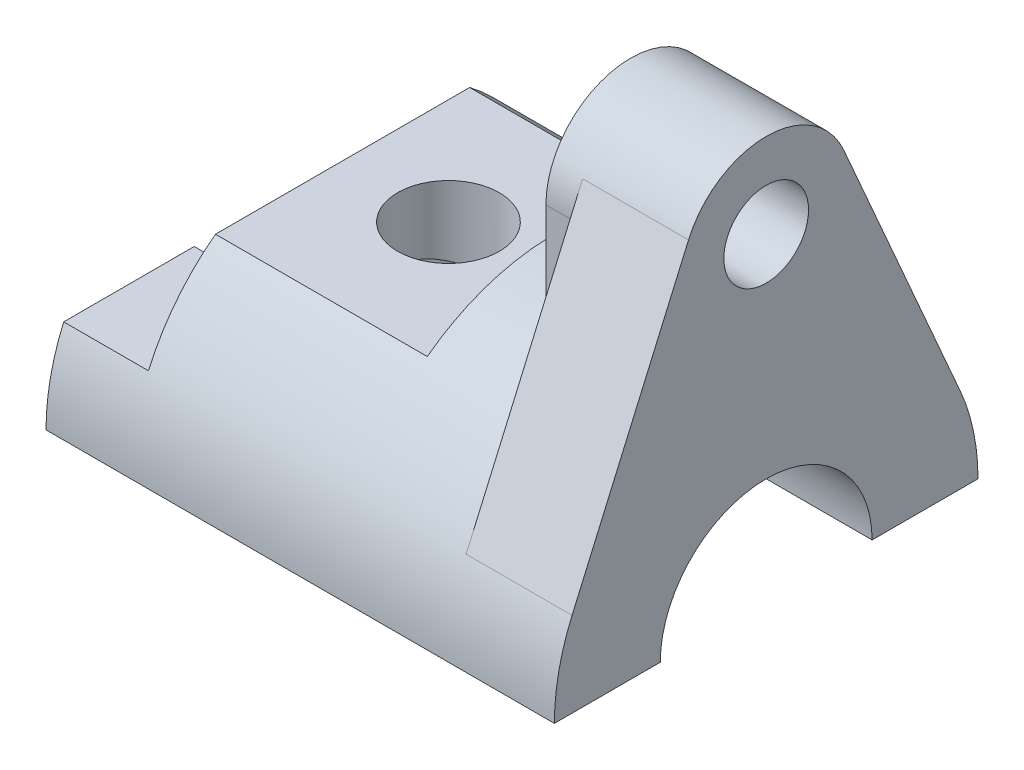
ISO-10303-21;
HEADER;
FILE_DESCRIPTION(('STEP AP214'),'2;1');
FILE_NAME('part.step','',(''),(''),'','','');
FILE_SCHEMA(('AUTOMOTIVE_DESIGN { 1 0 10303 214 1 1 1 1 }'));
ENDSEC;
DATA;
#1=APPLICATION_CONTEXT('core data for automotive mechanical design processes');
#2=APPLICATION_PROTOCOL_DEFINITION('international standard','automotive_design',2000,#1);
#3=PRODUCT_CONTEXT('',#1,'mechanical');
#4=PRODUCT('Part','Part','',(#3));
#5=PRODUCT_RELATED_PRODUCT_CATEGORY('part','',(#4));
#6=PRODUCT_DEFINITION_FORMATION('','',#4);
#7=PRODUCT_DEFINITION_CONTEXT('part definition',#1,'design');
#8=PRODUCT_DEFINITION('design','',#6,#7);
#9=PRODUCT_DEFINITION_SHAPE('','',#8);
#10=(LENGTH_UNIT() NAMED_UNIT(*) SI_UNIT(.MILLI.,.METRE.));
#11=(NAMED_UNIT(*) PLANE_ANGLE_UNIT() SI_UNIT($,.RADIAN.));
#12=(NAMED_UNIT(*) SI_UNIT($,.STERADIAN.) SOLID_ANGLE_UNIT());
#13=UNCERTAINTY_MEASURE_WITH_UNIT(LENGTH_MEASURE(1.E-05),#10,'distance_accuracy_value','');
#14=(GEOMETRIC_REPRESENTATION_CONTEXT(3) GLOBAL_UNCERTAINTY_ASSIGNED_CONTEXT((#13)) GLOBAL_UNIT_ASSIGNED_CONTEXT((#10,
#11,#12)) REPRESENTATION_CONTEXT('',''));
#15=CARTESIAN_POINT('',(0.,0.,0.));
#16=DIRECTION('',(0.,0.,1.));
#17=DIRECTION('',(1.,0.,0.));
#18=AXIS2_PLACEMENT_3D('',#15,#16,#17);
#19=CARTESIAN_POINT('',(-120.,0.,0.));
#20=DIRECTION('',(1.,0.,0.));
#21=DIRECTION('',(0.,0.,-1.));
#22=AXIS2_PLACEMENT_3D('',#19,#20,#21);
#23=PLANE('',#22);
#24=CARTESIAN_POINT('',(-120.,0.,0.));
#25=DIRECTION('',(1.,0.,0.));
#26=DIRECTION('',(0.,0.,-1.));
#27=AXIS2_PLACEMENT_3D('',#24,#25,#26);
#28=CIRCLE('',#27,50.);
#29=CARTESIAN_POINT('',(-120.,20.,45.8257569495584));
#30=VERTEX_POINT('',#29);
#31=CARTESIAN_POINT('',(-120.,0.,50.));
#32=VERTEX_POINT('',#31);
#33=EDGE_CURVE('E250',#30,#32,#28,.T.);
#34=ORIENTED_EDGE('',*,*,#33,.F.);
#35=DIRECTION('',(0.,0.,-1.));
#36=VECTOR('',#35,1.);
#37=CARTESIAN_POINT('',(-120.,20.,0.));
#38=LINE('',#37,#36);
#39=CARTESIAN_POINT('',(-120.,20.,15.));
#40=VERTEX_POINT('',#39);
#41=EDGE_CURVE('E283',#30,#40,#38,.T.);
#42=ORIENTED_EDGE('',*,*,#41,.T.);
#43=CARTESIAN_POINT('',(-120.,0.,0.));
#44=DIRECTION('',(-1.,0.,0.));
#45=DIRECTION('',(0.,0.,-1.));
#46=AXIS2_PLACEMENT_3D('',#43,#44,#45);
#47=CIRCLE('',#46,25.);
#48=CARTESIAN_POINT('',(-120.,0.,25.));
#49=VERTEX_POINT('',#48);
#50=EDGE_CURVE('E254',#49,#40,#47,.T.);
#51=ORIENTED_EDGE('',*,*,#50,.F.);
#52=DIRECTION('',(0.,0.,-1.));
#53=VECTOR('',#52,1.);
#54=CARTESIAN_POINT('',(-120.,0.,50.));
#55=LINE('',#54,#53);
#56=EDGE_CURVE('E249',#32,#49,#55,.T.);
#57=ORIENTED_EDGE('',*,*,#56,.F.);
#58=EDGE_LOOP('',(#34,#42,#51,#57));
#59=FACE_BOUND('',#58,.T.);
#60=ADVANCED_FACE('F31',(#59),#23,.F.);
#61=CARTESIAN_POINT('',(-120.,0.,0.));
#62=DIRECTION('',(1.,0.,0.));
#63=DIRECTION('',(0.,0.,-1.));
#64=AXIS2_PLACEMENT_3D('',#61,#62,#63);
#65=CYLINDRICAL_SURFACE('',#64,50.);
#66=DIRECTION('',(1.,0.,0.));
#67=VECTOR('',#66,1.);
#68=CARTESIAN_POINT('',(-120.,40.,-30.));
#69=LINE('',#68,#67);
#70=CARTESIAN_POINT('',(-50.,40.,-30.));
#71=VERTEX_POINT('',#70);
#72=CARTESIAN_POINT('',(-100.,40.,-30.));
#73=VERTEX_POINT('',#72);
#74=EDGE_CURVE('E46',#71,#73,#69,.F.);
#75=ORIENTED_EDGE('',*,*,#74,.F.);
#76=CARTESIAN_POINT('',(-50.,0.,0.));
#77=DIRECTION('',(1.,0.,0.));
#78=DIRECTION('',(0.,0.,-1.));
#79=AXIS2_PLACEMENT_3D('',#76,#77,#78);
#80=CIRCLE('',#79,50.);
#81=CARTESIAN_POINT('',(-50.,40.,30.));
#82=VERTEX_POINT('',#81);
#83=EDGE_CURVE('E11',#82,#71,#80,.F.);
#84=ORIENTED_EDGE('',*,*,#83,.F.);
#85=DIRECTION('',(1.,0.,0.));
#86=VECTOR('',#85,1.);
#87=CARTESIAN_POINT('',(-120.,40.,30.));
#88=LINE('',#87,#86);
#89=CARTESIAN_POINT('',(-100.,40.,30.));
#90=VERTEX_POINT('',#89);
#91=EDGE_CURVE('E156',#90,#82,#88,.T.);
#92=ORIENTED_EDGE('',*,*,#91,.F.);
#93=CARTESIAN_POINT('',(-100.,0.,0.));
#94=DIRECTION('',(-1.,0.,0.));
#95=DIRECTION('',(0.,0.,1.));
#96=AXIS2_PLACEMENT_3D('',#93,#94,#95);
#97=CIRCLE('',#96,50.);
#98=CARTESIAN_POINT('',(-100.,20.,45.8257569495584));
#99=VERTEX_POINT('',#98);
#100=EDGE_CURVE('E165',#90,#99,#97,.F.);
#101=ORIENTED_EDGE('',*,*,#100,.T.);
#102=DIRECTION('',(1.,0.,0.));
#103=VECTOR('',#102,1.);
#104=CARTESIAN_POINT('',(-120.,20.,45.8257569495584));
#105=LINE('',#104,#103);
#106=EDGE_CURVE('E176',#30,#99,#105,.T.);
#107=ORIENTED_EDGE('',*,*,#106,.F.);
#108=ORIENTED_EDGE('',*,*,#33,.T.);
#109=DIRECTION('',(1.,0.,0.));
#110=VECTOR('',#109,1.);
#111=CARTESIAN_POINT('',(-120.,0.,50.));
#112=LINE('',#111,#110);
#113=CARTESIAN_POINT('',(0.,0.,50.));
#114=VERTEX_POINT('',#113);
#115=EDGE_CURVE('E260',#32,#114,#112,.T.);
#116=ORIENTED_EDGE('',*,*,#115,.T.);
#117=CARTESIAN_POINT('',(0.,0.,0.));
#118=DIRECTION('',(1.,0.,0.));
#119=DIRECTION('',(0.,0.,-1.));
#120=AXIS2_PLACEMENT_3D('',#117,#118,#119);
#121=CIRCLE('',#120,50.);
#122=CARTESIAN_POINT('',(0.,20.,45.8257569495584));
#123=VERTEX_POINT('',#122);
#124=EDGE_CURVE('E238',#123,#114,#121,.T.);
#125=ORIENTED_EDGE('',*,*,#124,.F.);
#126=DIRECTION('',(1.,0.,0.));
#127=VECTOR('',#126,1.);
#128=CARTESIAN_POINT('',(-25.,20.,45.8257569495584));
#129=LINE('',#128,#127);
#130=CARTESIAN_POINT('',(-25.,20.,45.8257569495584));
#131=VERTEX_POINT('',#130);
#132=EDGE_CURVE('E242',#131,#123,#129,.T.);
#133=ORIENTED_EDGE('',*,*,#132,.F.);
#134=CARTESIAN_POINT('',(-25.,0.,0.));
#135=DIRECTION('',(-1.,0.,0.));
#136=DIRECTION('',(0.,0.,-1.));
#137=AXIS2_PLACEMENT_3D('',#134,#135,#136);
#138=CIRCLE('',#137,50.);
#139=CARTESIAN_POINT('',(-25.,45.8257569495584,20.));
#140=VERTEX_POINT('',#139);
#141=EDGE_CURVE('E223',#131,#140,#138,.T.);
#142=ORIENTED_EDGE('',*,*,#141,.T.);
#143=DIRECTION('',(1.,0.,0.));
#144=VECTOR('',#143,1.);
#145=CARTESIAN_POINT('',(-32.,45.8257569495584,20.));
#146=LINE('',#145,#144);
#147=CARTESIAN_POINT('',(-32.,45.8257569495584,20.));
#148=VERTEX_POINT('',#147);
#149=EDGE_CURVE('E206',#148,#140,#146,.T.);
#150=ORIENTED_EDGE('',*,*,#149,.F.);
#151=CARTESIAN_POINT('',(-32.,0.,0.));
#152=DIRECTION('',(1.,0.,0.));
#153=DIRECTION('',(0.,0.,1.));
#154=AXIS2_PLACEMENT_3D('',#151,#152,#153);
#155=CIRCLE('',#154,50.);
#156=CARTESIAN_POINT('',(-32.,45.8257569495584,-20.));
#157=VERTEX_POINT('',#156);
#158=EDGE_CURVE('E190',#157,#148,#155,.T.);
#159=ORIENTED_EDGE('',*,*,#158,.F.);
#160=DIRECTION('',(1.,0.,0.));
#161=VECTOR('',#160,1.);
#162=CARTESIAN_POINT('',(-32.,45.8257569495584,-20.));
#163=LINE('',#162,#161);
#164=CARTESIAN_POINT('',(-25.,45.8257569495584,-20.));
#165=VERTEX_POINT('',#164);
#166=EDGE_CURVE('E209',#157,#165,#163,.T.);
#167=ORIENTED_EDGE('',*,*,#166,.T.);
#168=CARTESIAN_POINT('',(-25.,20.,-45.8257569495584));
#169=VERTEX_POINT('',#168);
#170=EDGE_CURVE('E221',#165,#169,#138,.T.);
#171=ORIENTED_EDGE('',*,*,#170,.T.);
#172=DIRECTION('',(1.,0.,0.));
#173=VECTOR('',#172,1.);
#174=CARTESIAN_POINT('',(-25.,20.,-45.8257569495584));
#175=LINE('',#174,#173);
#176=CARTESIAN_POINT('',(0.,20.,-45.8257569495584));
#177=VERTEX_POINT('',#176);
#178=EDGE_CURVE('E239',#169,#177,#175,.T.);
#179=ORIENTED_EDGE('',*,*,#178,.T.);
#180=CARTESIAN_POINT('',(0.,0.,-50.));
#181=VERTEX_POINT('',#180);
#182=EDGE_CURVE('E261',#181,#177,#121,.T.);
#183=ORIENTED_EDGE('',*,*,#182,.F.);
#184=DIRECTION('',(1.,0.,0.));
#185=VECTOR('',#184,1.);
#186=CARTESIAN_POINT('',(-120.,0.,-50.));
#187=LINE('',#186,#185);
#188=CARTESIAN_POINT('',(-120.,0.,-50.));
#189=VERTEX_POINT('',#188);
#190=EDGE_CURVE('E273',#189,#181,#187,.T.);
#191=ORIENTED_EDGE('',*,*,#190,.F.);
#192=CARTESIAN_POINT('',(-120.,20.,-45.8257569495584));
#193=VERTEX_POINT('',#192);
#194=EDGE_CURVE('E246',#189,#193,#28,.T.);
#195=ORIENTED_EDGE('',*,*,#194,.T.);
#196=DIRECTION('',(1.,0.,0.));
#197=VECTOR('',#196,1.);
#198=CARTESIAN_POINT('',(-120.,20.,-45.8257569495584));
#199=LINE('',#198,#197);
#200=CARTESIAN_POINT('',(-100.,20.,-45.8257569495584));
#201=VERTEX_POINT('',#200);
#202=EDGE_CURVE('E54',#201,#193,#199,.F.);
#203=ORIENTED_EDGE('',*,*,#202,.F.);
#204=EDGE_CURVE('E173',#201,#73,#97,.F.);
#205=ORIENTED_EDGE('',*,*,#204,.T.);
#206=EDGE_LOOP('',(#75,#84,#92,#101,#107,#108,#116,#125,#133,#142,#150,#159,#167,#171,#179,#183,
#191,#195,#203,#205));
#207=FACE_BOUND('',#206,.T.);
#208=ADVANCED_FACE('F33',(#207),#65,.T.);
#209=CARTESIAN_POINT('',(-25.,75.,0.));
#210=DIRECTION('',(1.,0.,0.));
#211=DIRECTION('',(0.,0.,-1.));
#212=AXIS2_PLACEMENT_3D('',#209,#210,#211);
#213=PLANE('',#212);
#214=CARTESIAN_POINT('',(-25.,75.,0.));
#215=DIRECTION('',(-1.,0.,0.));
#216=DIRECTION('',(0.,0.,1.));
#217=AXIS2_PLACEMENT_3D('',#214,#215,#216);
#218=CIRCLE('',#217,20.);
#219=CARTESIAN_POINT('',(-25.,83.,-18.3303027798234));
#220=VERTEX_POINT('',#219);
#221=CARTESIAN_POINT('',(-25.,75.,-20.));
#222=VERTEX_POINT('',#221);
#223=EDGE_CURVE('E182',#220,#222,#218,.T.);
#224=ORIENTED_EDGE('',*,*,#223,.F.);
#225=DIRECTION('',(0.,0.916515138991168,0.4));
#226=VECTOR('',#225,1.);
#227=CARTESIAN_POINT('',(-25.,83.,-18.3303027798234));
#228=LINE('',#227,#226);
#229=EDGE_CURVE('E226',#169,#220,#228,.T.);
#230=ORIENTED_EDGE('',*,*,#229,.F.);
#231=ORIENTED_EDGE('',*,*,#170,.F.);
#232=DIRECTION('',(0.,-1.,0.));
#233=VECTOR('',#232,1.);
#234=CARTESIAN_POINT('',(-25.,75.,-20.));
#235=LINE('',#234,#233);
#236=EDGE_CURVE('E199',#222,#165,#235,.T.);
#237=ORIENTED_EDGE('',*,*,#236,.F.);
#238=EDGE_LOOP('',(#224,#230,#231,#237));
#239=FACE_BOUND('',#238,.T.);
#240=ADVANCED_FACE('F356',(#239),#213,.F.);
#241=CARTESIAN_POINT('',(-25.,75.,20.));
#242=VERTEX_POINT('',#241);
#243=CARTESIAN_POINT('',(-25.,83.,18.3303027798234));
#244=VERTEX_POINT('',#243);
#245=EDGE_CURVE('E196',#242,#244,#218,.T.);
#246=ORIENTED_EDGE('',*,*,#245,.F.);
#247=DIRECTION('',(0.,1.,0.));
#248=VECTOR('',#247,1.);
#249=CARTESIAN_POINT('',(-25.,75.,20.));
#250=LINE('',#249,#248);
#251=EDGE_CURVE('E187',#140,#242,#250,.T.);
#252=ORIENTED_EDGE('',*,*,#251,.F.);
#253=ORIENTED_EDGE('',*,*,#141,.F.);
#254=DIRECTION('',(0.,-0.916515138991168,0.4));
#255=VECTOR('',#254,1.);
#256=CARTESIAN_POINT('',(-25.,83.,18.3303027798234));
#257=LINE('',#256,#255);
#258=EDGE_CURVE('E218',#244,#131,#257,.T.);
#259=ORIENTED_EDGE('',*,*,#258,.F.);
#260=EDGE_LOOP('',(#246,#252,#253,#259));
#261=FACE_BOUND('',#260,.T.);
#262=ADVANCED_FACE('F359',(#261),#213,.F.);
#263=CARTESIAN_POINT('',(-120.,0.,-25.));
#264=DIRECTION('',(0.,-1.,0.));
#265=DIRECTION('',(0.,0.,-1.));
#266=AXIS2_PLACEMENT_3D('',#263,#264,#265);
#267=PLANE('',#266);
#268=DIRECTION('',(0.,0.,-1.));
#269=VECTOR('',#268,1.);
#270=CARTESIAN_POINT('',(0.,0.,-25.));
#271=LINE('',#270,#269);
#272=CARTESIAN_POINT('',(0.,0.,-25.));
#273=VERTEX_POINT('',#272);
#274=EDGE_CURVE('E270',#273,#181,#271,.T.);
#275=ORIENTED_EDGE('',*,*,#274,.F.);
#276=DIRECTION('',(1.,0.,0.));
#277=VECTOR('',#276,1.);
#278=CARTESIAN_POINT('',(-120.,0.,-25.));
#279=LINE('',#278,#277);
#280=CARTESIAN_POINT('',(-120.,0.,-25.));
#281=VERTEX_POINT('',#280);
#282=EDGE_CURVE('E276',#281,#273,#279,.T.);
#283=ORIENTED_EDGE('',*,*,#282,.F.);
#284=DIRECTION('',(0.,0.,-1.));
#285=VECTOR('',#284,1.);
#286=CARTESIAN_POINT('',(-120.,0.,-25.));
#287=LINE('',#286,#285);
#288=EDGE_CURVE('E257',#281,#189,#287,.T.);
#289=ORIENTED_EDGE('',*,*,#288,.T.);
#290=ORIENTED_EDGE('',*,*,#190,.T.);
#291=EDGE_LOOP('',(#275,#283,#289,#290));
#292=FACE_BOUND('',#291,.T.);
#293=ADVANCED_FACE('F379',(#292),#267,.T.);
#294=CARTESIAN_POINT('',(-120.,0.,0.));
#295=DIRECTION('',(1.,0.,0.));
#296=DIRECTION('',(0.,0.,-1.));
#297=AXIS2_PLACEMENT_3D('',#294,#295,#296);
#298=CYLINDRICAL_SURFACE('',#297,25.);
#299=CARTESIAN_POINT('',(-75.,21.9317121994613,12.));
#300=CARTESIAN_POINT('',(-75.314700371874,21.9317148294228,11.999997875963));
#301=CARTESIAN_POINT('',(-75.6294505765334,21.9385090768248,11.9876034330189));
#302=CARTESIAN_POINT('',(-76.2565627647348,21.9654434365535,11.9381766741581));
#303=CARTESIAN_POINT('',(-76.5689234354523,21.9855904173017,11.9011316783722));
#304=CARTESIAN_POINT('',(-77.1893468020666,22.0385460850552,11.8027795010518));
#305=CARTESIAN_POINT('',(-77.497399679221,22.0713799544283,11.741424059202));
#306=CARTESIAN_POINT('',(-78.1063419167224,22.1485467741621,11.5952012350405));
#307=CARTESIAN_POINT('',(-78.407232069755,22.1928784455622,11.5103364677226));
#308=CARTESIAN_POINT('',(-78.9984939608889,22.2913297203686,11.318487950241));
#309=CARTESIAN_POINT('',(-79.2889109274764,22.3453990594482,11.2116174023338));
#310=CARTESIAN_POINT('',(-79.8592153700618,22.4618348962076,10.9764826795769));
#311=CARTESIAN_POINT('',(-80.1391025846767,22.5242015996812,10.8482179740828));
#312=CARTESIAN_POINT('',(-80.6869026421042,22.6554662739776,10.5713434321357));
#313=CARTESIAN_POINT('',(-80.9548190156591,22.7243623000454,10.4227396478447));
#314=CARTESIAN_POINT('',(-81.4776869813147,22.8669439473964,10.1060887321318));
#315=CARTESIAN_POINT('',(-81.7326337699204,22.9406313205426,9.93803447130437));
#316=CARTESIAN_POINT('',(-82.2471519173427,23.0966805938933,9.57006952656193));
#317=CARTESIAN_POINT('',(-82.5056178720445,23.179277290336,9.368711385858));
#318=CARTESIAN_POINT('',(-83.0050053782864,23.3457636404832,8.94577922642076));
#319=CARTESIAN_POINT('',(-83.2459260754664,23.4296533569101,8.72420422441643));
#320=CARTESIAN_POINT('',(-83.7091601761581,23.5966685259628,8.26182092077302));
#321=CARTESIAN_POINT('',(-83.9314619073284,23.6797934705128,8.02100073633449));
#322=CARTESIAN_POINT('',(-84.355984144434,23.8431555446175,7.5214996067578));
#323=CARTESIAN_POINT('',(-84.558211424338,23.9233936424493,7.26282473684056));
#324=CARTESIAN_POINT('',(-84.9531472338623,24.0838245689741,6.71241360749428));
#325=CARTESIAN_POINT('',(-85.1445134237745,24.1637134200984,6.41962274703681));
#326=CARTESIAN_POINT('',(-85.5017145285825,24.3158361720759,5.81693196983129));
#327=CARTESIAN_POINT('',(-85.6675481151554,24.388069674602,5.50703116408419));
#328=CARTESIAN_POINT('',(-85.9720067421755,24.522770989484,4.87225906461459));
#329=CARTESIAN_POINT('',(-86.1106440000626,24.5852431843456,4.54739457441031));
#330=CARTESIAN_POINT('',(-86.3592485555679,24.6985885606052,3.88491996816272));
#331=CARTESIAN_POINT('',(-86.4692186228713,24.749462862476,3.54731108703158));
#332=CARTESIAN_POINT('',(-86.6528076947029,24.8350918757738,2.88483126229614));
#333=CARTESIAN_POINT('',(-86.7283561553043,24.8706928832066,2.56060390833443));
#334=CARTESIAN_POINT('',(-86.8523655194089,24.9294118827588,1.90588971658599));
#335=CARTESIAN_POINT('',(-86.9008275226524,24.9525303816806,1.57540313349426));
#336=CARTESIAN_POINT('',(-86.9700251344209,24.9856074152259,0.911038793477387));
#337=CARTESIAN_POINT('',(-86.9907736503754,24.9955720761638,0.57716268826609));
#338=CARTESIAN_POINT('',(-87.0043074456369,25.002067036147,-0.0912787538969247));
#339=CARTESIAN_POINT('',(-86.9970942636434,24.998598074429,-0.425844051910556));
#340=CARTESIAN_POINT('',(-86.956512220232,24.9791495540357,-1.06595138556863));
#341=CARTESIAN_POINT('',(-86.9252932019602,24.9641984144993,-1.3716639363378));
#342=CARTESIAN_POINT('',(-86.8396519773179,24.9234014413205,-1.97906443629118));
#343=CARTESIAN_POINT('',(-86.7852312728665,24.8975563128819,-2.28075264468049));
#344=CARTESIAN_POINT('',(-86.6537628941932,24.8355960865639,-2.87807982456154));
#345=CARTESIAN_POINT('',(-86.5767144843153,24.7994806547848,-3.17371859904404));
#346=CARTESIAN_POINT('',(-86.4007539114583,24.7178299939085,-3.75707833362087));
#347=CARTESIAN_POINT('',(-86.3018409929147,24.6722944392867,-4.04479901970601));
#348=CARTESIAN_POINT('',(-86.0814615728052,24.5721187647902,-4.61474979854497));
#349=CARTESIAN_POINT('',(-85.9596888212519,24.5173561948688,-4.89683977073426));
#350=CARTESIAN_POINT('',(-85.6955849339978,24.4004409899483,-5.44961462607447));
#351=CARTESIAN_POINT('',(-85.5532537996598,24.3382883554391,-5.72029950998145));
#352=CARTESIAN_POINT('',(-85.2490678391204,24.2079430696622,-6.24897007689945));
#353=CARTESIAN_POINT('',(-85.0872109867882,24.1397497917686,-6.50695443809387));
#354=CARTESIAN_POINT('',(-84.7449703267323,23.998752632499,-7.00913169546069));
#355=CARTESIAN_POINT('',(-84.5645793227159,23.9259469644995,-7.25331917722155));
#356=CARTESIAN_POINT('',(-84.1695425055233,23.7706680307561,-7.74779416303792));
#357=CARTESIAN_POINT('',(-83.9532774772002,23.6879101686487,-7.99670032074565));
#358=CARTESIAN_POINT('',(-83.5013107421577,23.5208035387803,-8.4756204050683));
#359=CARTESIAN_POINT('',(-83.2656080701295,23.4364546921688,-8.70563339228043));
#360=CARTESIAN_POINT('',(-82.7758590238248,23.2682417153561,-9.14573444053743));
#361=CARTESIAN_POINT('',(-82.5218024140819,23.1843778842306,-9.35581123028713));
#362=CARTESIAN_POINT('',(-81.9966560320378,23.0193626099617,-9.75477129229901));
#363=CARTESIAN_POINT('',(-81.7255633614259,22.9382116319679,-9.94365094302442));
#364=CARTESIAN_POINT('',(-81.1522249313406,22.7765257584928,-10.3088279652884));
#365=CARTESIAN_POINT('',(-80.8490854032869,22.6962733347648,-10.4838511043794));
#366=CARTESIAN_POINT('',(-80.2271572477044,22.5440090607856,-10.8073876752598));
#367=CARTESIAN_POINT('',(-79.9083758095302,22.4719934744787,-10.9559131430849));
#368=CARTESIAN_POINT('',(-79.2572065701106,22.3388076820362,-11.2249817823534));
#369=CARTESIAN_POINT('',(-78.9248261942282,22.2776316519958,-11.3455399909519));
#370=CARTESIAN_POINT('',(-78.2487302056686,22.1685145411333,-11.5573001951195));
#371=CARTESIAN_POINT('',(-77.9050160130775,22.1205718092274,-11.6485058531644));
#372=CARTESIAN_POINT('',(-77.2358515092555,22.0430763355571,-11.7944510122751));
#373=CARTESIAN_POINT('',(-76.9110248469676,22.0123943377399,-11.8514525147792));
#374=CARTESIAN_POINT('',(-76.2567570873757,21.9652686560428,-11.9385697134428));
#375=CARTESIAN_POINT('',(-75.9273162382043,21.9488242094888,-11.9686868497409));
#376=CARTESIAN_POINT('',(-75.2668321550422,21.9308520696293,-12.0015866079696));
#377=CARTESIAN_POINT('',(-74.9357898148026,21.9293168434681,-12.0043830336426));
#378=CARTESIAN_POINT('',(-74.2748867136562,21.9412089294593,-11.9826336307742));
#379=CARTESIAN_POINT('',(-73.9450258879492,21.9546354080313,-11.958089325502));
#380=CARTESIAN_POINT('',(-73.3212707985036,21.9938814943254,-11.88573353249));
#381=CARTESIAN_POINT('',(-73.0269982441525,22.0183690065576,-11.840416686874));
#382=CARTESIAN_POINT('',(-72.4436095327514,22.0782906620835,-11.7283042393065));
#383=CARTESIAN_POINT('',(-72.154495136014,22.1137284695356,-11.6615014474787));
#384=CARTESIAN_POINT('',(-71.5833414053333,22.1944501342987,-11.5071262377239));
#385=CARTESIAN_POINT('',(-71.3013009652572,22.2397324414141,-11.4195570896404));
#386=CARTESIAN_POINT('',(-70.7456691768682,22.3388575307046,-11.2244115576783));
#387=CARTESIAN_POINT('',(-70.4720812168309,22.3927036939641,-11.1168272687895));
#388=CARTESIAN_POINT('',(-69.9224421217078,22.5101362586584,-10.8771491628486));
#389=CARTESIAN_POINT('',(-69.646854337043,22.5740562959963,-10.7441570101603));
#390=CARTESIAN_POINT('',(-69.1076571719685,22.7079601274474,-10.4581774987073));
#391=CARTESIAN_POINT('',(-68.8440530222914,22.7779465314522,-10.3051815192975));
#392=CARTESIAN_POINT('',(-68.3300122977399,22.9222132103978,-9.98016786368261));
#393=CARTESIAN_POINT('',(-68.0795783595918,22.9964943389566,-9.80814639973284));
#394=CARTESIAN_POINT('',(-67.5929404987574,23.1475921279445,-9.44602935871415));
#395=CARTESIAN_POINT('',(-67.3567374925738,23.2244089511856,-9.25593261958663));
#396=CARTESIAN_POINT('',(-66.87332120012,23.3877186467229,-8.83578243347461));
#397=CARTESIAN_POINT('',(-66.6279474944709,23.4743116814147,-8.60364645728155));
#398=CARTESIAN_POINT('',(-66.1574914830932,23.6461839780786,-8.11935832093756));
#399=CARTESIAN_POINT('',(-65.9324029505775,23.7314636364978,-7.86721234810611));
#400=CARTESIAN_POINT('',(-65.5036339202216,23.8985765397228,-7.34394385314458));
#401=CARTESIAN_POINT('',(-65.2999680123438,23.9804074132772,-7.07280860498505));
#402=CARTESIAN_POINT('',(-64.9157209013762,24.1383931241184,-6.51325170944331));
#403=CARTESIAN_POINT('',(-64.7351297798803,24.2145503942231,-6.2248375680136));
#404=CARTESIAN_POINT('',(-64.3951325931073,24.3606072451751,-5.62649544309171));
#405=CARTESIAN_POINT('',(-64.2362031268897,24.4303575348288,-5.31625950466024));
#406=CARTESIAN_POINT('',(-63.9452879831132,24.5599203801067,-4.68137370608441));
#407=CARTESIAN_POINT('',(-63.8133030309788,24.6197326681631,-4.35672345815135));
#408=CARTESIAN_POINT('',(-63.5778401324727,24.727611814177,-3.69558010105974));
#409=CARTESIAN_POINT('',(-63.4743433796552,24.7756864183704,-3.35909497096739));
#410=CARTESIAN_POINT('',(-63.2970557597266,24.8586555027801,-2.67680612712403));
#411=CARTESIAN_POINT('',(-63.2232617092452,24.8935513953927,-2.33100341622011));
#412=CARTESIAN_POINT('',(-63.111467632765,24.9466433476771,-1.6634810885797));
#413=CARTESIAN_POINT('',(-63.070913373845,24.9660275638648,-1.34228158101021));
#414=CARTESIAN_POINT('',(-63.0158956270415,24.9923621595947,-0.697153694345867));
#415=CARTESIAN_POINT('',(-63.001430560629,24.9993132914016,-0.373225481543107));
#416=CARTESIAN_POINT('',(-62.9987717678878,25.0005895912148,0.274677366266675));
#417=CARTESIAN_POINT('',(-63.0105713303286,24.9949179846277,0.59865196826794));
#418=CARTESIAN_POINT('',(-63.0602795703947,24.9711122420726,1.24412403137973));
#419=CARTESIAN_POINT('',(-63.0981877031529,24.952978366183,1.56562154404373));
#420=CARTESIAN_POINT('',(-63.1967140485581,24.9061399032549,2.18519993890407));
#421=CARTESIAN_POINT('',(-63.2558959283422,24.878105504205,2.48356172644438));
#422=CARTESIAN_POINT('',(-63.3964086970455,24.8120834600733,3.07387659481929));
#423=CARTESIAN_POINT('',(-63.4777384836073,24.7740963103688,3.36582999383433));
#424=CARTESIAN_POINT('',(-63.6617751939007,24.6890398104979,3.94157481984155));
#425=CARTESIAN_POINT('',(-63.7644840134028,24.6419696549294,4.2253655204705));
#426=CARTESIAN_POINT('',(-63.990378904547,24.5397965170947,4.78317910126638));
#427=CARTESIAN_POINT('',(-64.1135659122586,24.4846931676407,5.0572015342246));
#428=CARTESIAN_POINT('',(-64.3853561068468,24.3650389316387,5.60599791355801));
#429=CARTESIAN_POINT('',(-64.5348446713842,24.3001772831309,5.88026544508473));
#430=CARTESIAN_POINT('',(-64.854034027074,24.1644316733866,6.41533046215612));
#431=CARTESIAN_POINT('',(-65.0237421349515,24.0935455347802,6.67612302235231));
#432=CARTESIAN_POINT('',(-65.3822592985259,23.9473201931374,7.182997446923));
#433=CARTESIAN_POINT('',(-65.571072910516,23.8719799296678,7.42907577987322));
#434=CARTESIAN_POINT('',(-65.9666752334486,23.7185101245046,7.9053709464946));
#435=CARTESIAN_POINT('',(-66.1734633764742,23.6403806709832,8.13558828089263));
#436=CARTESIAN_POINT('',(-66.6239037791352,23.4757549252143,8.59971090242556));
#437=CARTESIAN_POINT('',(-66.8691967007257,23.3891529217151,8.83198927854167));
#438=CARTESIAN_POINT('',(-67.3786845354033,23.2169544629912,9.27521245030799));
#439=CARTESIAN_POINT('',(-67.6428798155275,23.1313580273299,9.48615683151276));
#440=CARTESIAN_POINT('',(-68.18904669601,22.9634823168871,9.88561886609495));
#441=CARTESIAN_POINT('',(-68.471031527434,22.8812055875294,10.0741195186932));
#442=CARTESIAN_POINT('',(-69.0512034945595,22.7224633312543,10.4272311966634));
#443=CARTESIAN_POINT('',(-69.3493925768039,22.6459985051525,10.5918393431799));
#444=CARTESIAN_POINT('',(-69.9666122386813,22.4998508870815,10.8989097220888));
#445=CARTESIAN_POINT('',(-70.2859450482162,22.4303395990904,11.0408478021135));
#446=CARTESIAN_POINT('',(-70.9375889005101,22.3024934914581,11.2968701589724));
#447=CARTESIAN_POINT('',(-71.2698932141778,22.2441529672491,11.4109686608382));
#448=CARTESIAN_POINT('',(-71.9442938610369,22.1410614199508,11.6097338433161));
#449=CARTESIAN_POINT('',(-72.2863621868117,22.0962751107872,11.6944770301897));
#450=CARTESIAN_POINT('',(-72.9780605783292,22.0220395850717,11.8336828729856));
#451=CARTESIAN_POINT('',(-73.3276850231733,21.9925793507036,11.8881672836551));
#452=CARTESIAN_POINT('',(-73.8983996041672,21.9582702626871,11.9513624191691));
#453=CARTESIAN_POINT('',(-74.11818204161,21.948328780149,11.969588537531));
#454=CARTESIAN_POINT('',(-74.5586347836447,21.9350486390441,11.9939084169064));
#455=CARTESIAN_POINT('',(-74.7793051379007,21.931710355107,12.0000014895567));
#456=CARTESIAN_POINT('',(-75.,21.9317121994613,12.));
#457=B_SPLINE_CURVE_WITH_KNOTS('',3,(#299,#300,#301,#302,#303,#304,#305,#306,#307,#308,#309,
#310,#311,#312,#313,#314,#315,#316,#317,#318,#319,#320,#321,#322,#323,#324,#325,#326,#327,#328,
#329,#330,#331,#332,#333,#334,#335,#336,#337,#338,#339,#340,#341,#342,#343,#344,#345,#346,#347,
#348,#349,#350,#351,#352,#353,#354,#355,#356,#357,#358,#359,#360,#361,#362,#363,#364,#365,#366,
#367,#368,#369,#370,#371,#372,#373,#374,#375,#376,#377,#378,#379,#380,#381,#382,#383,#384,#385,
#386,#387,#388,#389,#390,#391,#392,#393,#394,#395,#396,#397,#398,#399,#400,#401,#402,#403,#404,
#405,#406,#407,#408,#409,#410,#411,#412,#413,#414,#415,#416,#417,#418,#419,#420,#421,#422,#423,
#424,#425,#426,#427,#428,#429,#430,#431,#432,#433,#434,#435,#436,#437,#438,#439,#440,#441,#442,
#443,#444,#445,#446,#447,#448,#449,#450,#451,#452,#453,#454,#455,#456),.UNSPECIFIED.,.T.,.F.,(4,
2,2,2,2,2,2,2,2,2,2,2,2,2,2,2,2,2,2,2,2,2,2,2,2,2,2,2,2,2,2,2,2,2,2,2,2,2,2,2,2,2,2,2,2,2,2,2,2,
2,2,2,2,2,2,2,2,2,2,2,2,2,2,2,2,2,2,2,2,2,2,2,2,2,2,2,2,2,4),(0.,0.943873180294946,
1.88823225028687,2.83447550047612,3.78061354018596,4.72200088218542,5.66341157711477,
6.60454274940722,7.54601998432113,8.55861483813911,9.57125896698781,10.5845332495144,
11.5974644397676,12.6724568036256,13.7475050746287,14.8220692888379,15.8965296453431,
16.8996162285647,17.9026620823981,18.9052406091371,19.9077639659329,20.8296734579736,
21.7515232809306,22.6734030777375,23.5953147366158,24.5305950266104,25.4658752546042,
26.4012526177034,27.3369945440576,28.3557676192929,29.374591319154,30.3939876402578,
31.4135578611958,32.4895353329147,33.5650228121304,34.639930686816,35.7147043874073,
36.7069664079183,37.6991752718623,38.6908827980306,39.6825350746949,40.5777569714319,
41.4732787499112,42.3686596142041,43.2643948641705,44.2012448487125,45.1384999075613,
46.0759418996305,47.0134442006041,48.0583683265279,49.1029705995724,50.1482797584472,
51.1931380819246,52.2581792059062,53.3232490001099,54.3876139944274,55.4518648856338,
56.4235862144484,57.3952487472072,58.3666630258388,59.3380570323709,60.2534104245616,
61.1687182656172,62.0841073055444,62.9995381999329,63.9555981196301,64.9120050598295,
65.8686406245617,66.8252459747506,67.8702942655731,68.9153628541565,69.96121809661,
71.0071992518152,72.0746586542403,73.1415714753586,74.2056823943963,75.2690272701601,
75.9309144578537,76.5928391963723),.UNSPECIFIED.);
#458=CARTESIAN_POINT('',(-75.,21.9317121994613,12.));
#459=VERTEX_POINT('',#458);
#460=EDGE_CURVE('E311',#459,#459,#457,.T.);
#461=ORIENTED_EDGE('',*,*,#460,.F.);
#462=EDGE_LOOP('',(#461));
#463=FACE_BOUND('',#462,.T.);
#464=DIRECTION('',(1.,0.,0.));
#465=VECTOR('',#464,1.);
#466=CARTESIAN_POINT('',(-120.,20.,-15.));
#467=LINE('',#466,#465);
#468=CARTESIAN_POINT('',(-120.,20.,-15.));
#469=VERTEX_POINT('',#468);
#470=CARTESIAN_POINT('',(-100.,20.,-15.));
#471=VERTEX_POINT('',#470);
#472=EDGE_CURVE('E303',#469,#471,#467,.T.);
#473=ORIENTED_EDGE('',*,*,#472,.F.);
#474=EDGE_CURVE('E253',#469,#281,#47,.T.);
#475=ORIENTED_EDGE('',*,*,#474,.T.);
#476=ORIENTED_EDGE('',*,*,#282,.T.);
#477=CARTESIAN_POINT('',(0.,0.,0.));
#478=DIRECTION('',(-1.,0.,0.));
#479=DIRECTION('',(0.,0.,-1.));
#480=AXIS2_PLACEMENT_3D('',#477,#478,#479);
#481=CIRCLE('',#480,25.);
#482=CARTESIAN_POINT('',(0.,0.,25.));
#483=VERTEX_POINT('',#482);
#484=EDGE_CURVE('E267',#483,#273,#481,.T.);
#485=ORIENTED_EDGE('',*,*,#484,.F.);
#486=DIRECTION('',(1.,0.,0.));
#487=VECTOR('',#486,1.);
#488=CARTESIAN_POINT('',(-120.,0.,25.));
#489=LINE('',#488,#487);
#490=EDGE_CURVE('E278',#49,#483,#489,.T.);
#491=ORIENTED_EDGE('',*,*,#490,.F.);
#492=ORIENTED_EDGE('',*,*,#50,.T.);
#493=DIRECTION('',(1.,0.,0.));
#494=VECTOR('',#493,1.);
#495=CARTESIAN_POINT('',(-120.,20.,15.));
#496=LINE('',#495,#494);
#497=CARTESIAN_POINT('',(-100.,20.,15.));
#498=VERTEX_POINT('',#497);
#499=EDGE_CURVE('E295',#498,#40,#496,.F.);
#500=ORIENTED_EDGE('',*,*,#499,.F.);
#501=CARTESIAN_POINT('',(-100.,0.,0.));
#502=DIRECTION('',(-1.,0.,0.));
#503=DIRECTION('',(0.,0.,1.));
#504=AXIS2_PLACEMENT_3D('',#501,#502,#503);
#505=CIRCLE('',#504,25.);
#506=EDGE_CURVE('E161',#498,#471,#505,.T.);
#507=ORIENTED_EDGE('',*,*,#506,.T.);
#508=EDGE_LOOP('',(#473,#475,#476,#485,#491,#492,#500,#507));
#509=FACE_BOUND('',#508,.T.);
#510=ADVANCED_FACE('F294',(#463,#509),#298,.F.);
#511=CARTESIAN_POINT('',(-120.,0.,50.));
#512=DIRECTION('',(0.,-1.,0.));
#513=DIRECTION('',(0.,0.,-1.));
#514=AXIS2_PLACEMENT_3D('',#511,#512,#513);
#515=PLANE('',#514);
#516=DIRECTION('',(0.,0.,-1.));
#517=VECTOR('',#516,1.);
#518=CARTESIAN_POINT('',(0.,0.,50.));
#519=LINE('',#518,#517);
#520=EDGE_CURVE('E264',#114,#483,#519,.T.);
#521=ORIENTED_EDGE('',*,*,#520,.F.);
#522=ORIENTED_EDGE('',*,*,#115,.F.);
#523=ORIENTED_EDGE('',*,*,#56,.T.);
#524=ORIENTED_EDGE('',*,*,#490,.T.);
#525=EDGE_LOOP('',(#521,#522,#523,#524));
#526=FACE_BOUND('',#525,.T.);
#527=ADVANCED_FACE('F299',(#526),#515,.T.);
#528=ORIENTED_EDGE('',*,*,#474,.F.);
#529=EDGE_CURVE('E275',#469,#193,#38,.T.);
#530=ORIENTED_EDGE('',*,*,#529,.T.);
#531=ORIENTED_EDGE('',*,*,#194,.F.);
#532=ORIENTED_EDGE('',*,*,#288,.F.);
#533=EDGE_LOOP('',(#528,#530,#531,#532));
#534=FACE_BOUND('',#533,.T.);
#535=ADVANCED_FACE('F373',(#534),#23,.F.);
#536=CARTESIAN_POINT('',(0.,0.,0.));
#537=DIRECTION('',(1.,0.,0.));
#538=DIRECTION('',(0.,0.,-1.));
#539=AXIS2_PLACEMENT_3D('',#536,#537,#538);
#540=PLANE('',#539);
#541=ORIENTED_EDGE('',*,*,#182,.T.);
#542=DIRECTION('',(0.,0.916515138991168,0.4));
#543=VECTOR('',#542,1.);
#544=CARTESIAN_POINT('',(0.,83.,-18.3303027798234));
#545=LINE('',#544,#543);
#546=CARTESIAN_POINT('',(0.,83.,-18.3303027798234));
#547=VERTEX_POINT('',#546);
#548=EDGE_CURVE('E222',#177,#547,#545,.T.);
#549=ORIENTED_EDGE('',*,*,#548,.T.);
#550=CARTESIAN_POINT('',(0.,75.,0.));
#551=DIRECTION('',(1.,0.,0.));
#552=DIRECTION('',(0.,0.,-1.));
#553=AXIS2_PLACEMENT_3D('',#550,#551,#552);
#554=CIRCLE('',#553,20.);
#555=CARTESIAN_POINT('',(0.,83.,18.3303027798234));
#556=VERTEX_POINT('',#555);
#557=EDGE_CURVE('E217',#547,#556,#554,.T.);
#558=ORIENTED_EDGE('',*,*,#557,.T.);
#559=DIRECTION('',(0.,-0.916515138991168,0.4));
#560=VECTOR('',#559,1.);
#561=CARTESIAN_POINT('',(0.,83.,18.3303027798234));
#562=LINE('',#561,#560);
#563=EDGE_CURVE('E232',#556,#123,#562,.T.);
#564=ORIENTED_EDGE('',*,*,#563,.T.);
#565=ORIENTED_EDGE('',*,*,#124,.T.);
#566=ORIENTED_EDGE('',*,*,#520,.T.);
#567=ORIENTED_EDGE('',*,*,#484,.T.);
#568=ORIENTED_EDGE('',*,*,#274,.T.);
#569=EDGE_LOOP('',(#541,#549,#558,#564,#565,#566,#567,#568));
#570=FACE_BOUND('',#569,.T.);
#571=CARTESIAN_POINT('',(0.,75.,0.));
#572=DIRECTION('',(1.,0.,0.));
#573=DIRECTION('',(0.,0.,-1.));
#574=AXIS2_PLACEMENT_3D('',#571,#572,#573);
#575=CIRCLE('',#574,10.);
#576=CARTESIAN_POINT('',(0.,75.,-10.));
#577=VERTEX_POINT('',#576);
#578=EDGE_CURVE('E214',#577,#577,#575,.T.);
#579=ORIENTED_EDGE('',*,*,#578,.F.);
#580=EDGE_LOOP('',(#579));
#581=FACE_BOUND('',#580,.T.);
#582=ADVANCED_FACE('F371',(#570,#581),#540,.T.);
#583=CARTESIAN_POINT('',(-25.,75.,0.));
#584=DIRECTION('',(1.,0.,0.));
#585=DIRECTION('',(0.,0.,-1.));
#586=AXIS2_PLACEMENT_3D('',#583,#584,#585);
#587=CYLINDRICAL_SURFACE('',#586,20.);
#588=ORIENTED_EDGE('',*,*,#557,.F.);
#589=DIRECTION('',(1.,0.,0.));
#590=VECTOR('',#589,1.);
#591=CARTESIAN_POINT('',(-25.,83.,-18.3303027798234));
#592=LINE('',#591,#590);
#593=EDGE_CURVE('E236',#220,#547,#592,.T.);
#594=ORIENTED_EDGE('',*,*,#593,.F.);
#595=ORIENTED_EDGE('',*,*,#223,.T.);
#596=DIRECTION('',(1.,0.,0.));
#597=VECTOR('',#596,1.);
#598=CARTESIAN_POINT('',(-32.,75.,-20.));
#599=LINE('',#598,#597);
#600=CARTESIAN_POINT('',(-32.,75.,-20.));
#601=VERTEX_POINT('',#600);
#602=EDGE_CURVE('E211',#601,#222,#599,.T.);
#603=ORIENTED_EDGE('',*,*,#602,.F.);
#604=CARTESIAN_POINT('',(-32.,75.,0.));
#605=DIRECTION('',(-1.,0.,0.));
#606=DIRECTION('',(0.,0.,1.));
#607=AXIS2_PLACEMENT_3D('',#604,#605,#606);
#608=CIRCLE('',#607,20.);
#609=CARTESIAN_POINT('',(-32.,75.,20.));
#610=VERTEX_POINT('',#609);
#611=EDGE_CURVE('E183',#610,#601,#608,.T.);
#612=ORIENTED_EDGE('',*,*,#611,.F.);
#613=DIRECTION('',(1.,0.,0.));
#614=VECTOR('',#613,1.);
#615=CARTESIAN_POINT('',(-32.,75.,20.));
#616=LINE('',#615,#614);
#617=EDGE_CURVE('E195',#610,#242,#616,.T.);
#618=ORIENTED_EDGE('',*,*,#617,.T.);
#619=ORIENTED_EDGE('',*,*,#245,.T.);
#620=DIRECTION('',(1.,0.,0.));
#621=VECTOR('',#620,1.);
#622=CARTESIAN_POINT('',(-25.,83.,18.3303027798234));
#623=LINE('',#622,#621);
#624=EDGE_CURVE('E229',#244,#556,#623,.T.);
#625=ORIENTED_EDGE('',*,*,#624,.T.);
#626=EDGE_LOOP('',(#588,#594,#595,#603,#612,#618,#619,#625));
#627=FACE_BOUND('',#626,.T.);
#628=ADVANCED_FACE('F364',(#627),#587,.T.);
#629=CARTESIAN_POINT('',(-25.,83.,-18.3303027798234));
#630=DIRECTION('',(0.,0.4,-0.916515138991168));
#631=DIRECTION('',(0.,0.916515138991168,0.4));
#632=AXIS2_PLACEMENT_3D('',#629,#630,#631);
#633=PLANE('',#632);
#634=ORIENTED_EDGE('',*,*,#548,.F.);
#635=ORIENTED_EDGE('',*,*,#178,.F.);
#636=ORIENTED_EDGE('',*,*,#229,.T.);
#637=ORIENTED_EDGE('',*,*,#593,.T.);
#638=EDGE_LOOP('',(#634,#635,#636,#637));
#639=FACE_BOUND('',#638,.T.);
#640=ADVANCED_FACE('F361',(#639),#633,.T.);
#641=CARTESIAN_POINT('',(-25.,83.,18.3303027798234));
#642=DIRECTION('',(0.,0.4,0.916515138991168));
#643=DIRECTION('',(0.,-0.916515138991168,0.4));
#644=AXIS2_PLACEMENT_3D('',#641,#642,#643);
#645=PLANE('',#644);
#646=ORIENTED_EDGE('',*,*,#563,.F.);
#647=ORIENTED_EDGE('',*,*,#624,.F.);
#648=ORIENTED_EDGE('',*,*,#258,.T.);
#649=ORIENTED_EDGE('',*,*,#132,.T.);
#650=EDGE_LOOP('',(#646,#647,#648,#649));
#651=FACE_BOUND('',#650,.T.);
#652=ADVANCED_FACE('F354',(#651),#645,.T.);
#653=CARTESIAN_POINT('',(-25.,75.,0.));
#654=DIRECTION('',(1.,0.,0.));
#655=DIRECTION('',(0.,0.,-1.));
#656=AXIS2_PLACEMENT_3D('',#653,#654,#655);
#657=CYLINDRICAL_SURFACE('',#656,10.);
#658=ORIENTED_EDGE('',*,*,#578,.T.);
#659=EDGE_LOOP('',(#658));
#660=FACE_BOUND('',#659,.T.);
#661=CARTESIAN_POINT('',(-32.,75.,0.));
#662=DIRECTION('',(-1.,0.,0.));
#663=DIRECTION('',(0.,0.,1.));
#664=AXIS2_PLACEMENT_3D('',#661,#662,#663);
#665=CIRCLE('',#664,10.);
#666=CARTESIAN_POINT('',(-32.,75.,10.));
#667=VERTEX_POINT('',#666);
#668=EDGE_CURVE('E175',#667,#667,#665,.T.);
#669=ORIENTED_EDGE('',*,*,#668,.T.);
#670=EDGE_LOOP('',(#669));
#671=FACE_BOUND('',#670,.T.);
#672=ADVANCED_FACE('F343',(#660,#671),#657,.F.);
#673=CARTESIAN_POINT('',(-32.,75.,0.));
#674=DIRECTION('',(-1.,0.,0.));
#675=DIRECTION('',(0.,0.,1.));
#676=AXIS2_PLACEMENT_3D('',#673,#674,#675);
#677=PLANE('',#676);
#678=ORIENTED_EDGE('',*,*,#611,.T.);
#679=DIRECTION('',(0.,-1.,0.));
#680=VECTOR('',#679,1.);
#681=CARTESIAN_POINT('',(-32.,75.,-20.));
#682=LINE('',#681,#680);
#683=EDGE_CURVE('E186',#601,#157,#682,.T.);
#684=ORIENTED_EDGE('',*,*,#683,.T.);
#685=ORIENTED_EDGE('',*,*,#158,.T.);
#686=DIRECTION('',(0.,1.,0.));
#687=VECTOR('',#686,1.);
#688=CARTESIAN_POINT('',(-32.,75.,20.));
#689=LINE('',#688,#687);
#690=EDGE_CURVE('E193',#148,#610,#689,.T.);
#691=ORIENTED_EDGE('',*,*,#690,.T.);
#692=EDGE_LOOP('',(#678,#684,#685,#691));
#693=FACE_BOUND('',#692,.T.);
#694=ORIENTED_EDGE('',*,*,#668,.F.);
#695=EDGE_LOOP('',(#694));
#696=FACE_BOUND('',#695,.T.);
#697=ADVANCED_FACE('F339',(#693,#696),#677,.T.);
#698=CARTESIAN_POINT('',(-32.,75.,-20.));
#699=DIRECTION('',(0.,0.,1.));
#700=DIRECTION('',(1.,0.,0.));
#701=AXIS2_PLACEMENT_3D('',#698,#699,#700);
#702=PLANE('',#701);
#703=ORIENTED_EDGE('',*,*,#236,.T.);
#704=ORIENTED_EDGE('',*,*,#166,.F.);
#705=ORIENTED_EDGE('',*,*,#683,.F.);
#706=ORIENTED_EDGE('',*,*,#602,.T.);
#707=EDGE_LOOP('',(#703,#704,#705,#706));
#708=FACE_BOUND('',#707,.T.);
#709=ADVANCED_FACE('F342',(#708),#702,.F.);
#710=CARTESIAN_POINT('',(-32.,75.,20.));
#711=DIRECTION('',(0.,0.,-1.));
#712=DIRECTION('',(-1.,0.,0.));
#713=AXIS2_PLACEMENT_3D('',#710,#711,#712);
#714=PLANE('',#713);
#715=ORIENTED_EDGE('',*,*,#251,.T.);
#716=ORIENTED_EDGE('',*,*,#617,.F.);
#717=ORIENTED_EDGE('',*,*,#690,.F.);
#718=ORIENTED_EDGE('',*,*,#149,.T.);
#719=EDGE_LOOP('',(#715,#716,#717,#718));
#720=FACE_BOUND('',#719,.T.);
#721=ADVANCED_FACE('F345',(#720),#714,.F.);
#722=CARTESIAN_POINT('',(-100.,20.,-58.6836075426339));
#723=DIRECTION('',(0.,-1.,0.));
#724=DIRECTION('',(0.,0.,-1.));
#725=AXIS2_PLACEMENT_3D('',#722,#723,#724);
#726=PLANE('',#725);
#727=ORIENTED_EDGE('',*,*,#202,.T.);
#728=ORIENTED_EDGE('',*,*,#529,.F.);
#729=ORIENTED_EDGE('',*,*,#472,.T.);
#730=DIRECTION('',(0.,0.,1.));
#731=VECTOR('',#730,1.);
#732=CARTESIAN_POINT('',(-100.,20.,-58.6836075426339));
#733=LINE('',#732,#731);
#734=EDGE_CURVE('E307',#201,#471,#733,.T.);
#735=ORIENTED_EDGE('',*,*,#734,.F.);
#736=EDGE_LOOP('',(#727,#728,#729,#735));
#737=FACE_BOUND('',#736,.T.);
#738=ADVANCED_FACE('F338',(#737),#726,.F.);
#739=ORIENTED_EDGE('',*,*,#106,.T.);
#740=EDGE_CURVE('E172',#498,#99,#733,.T.);
#741=ORIENTED_EDGE('',*,*,#740,.F.);
#742=ORIENTED_EDGE('',*,*,#499,.T.);
#743=ORIENTED_EDGE('',*,*,#41,.F.);
#744=EDGE_LOOP('',(#739,#741,#742,#743));
#745=FACE_BOUND('',#744,.T.);
#746=ADVANCED_FACE('F335',(#745),#726,.F.);
#747=CARTESIAN_POINT('',(-100.,20.,-58.6836075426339));
#748=DIRECTION('',(-1.,0.,0.));
#749=DIRECTION('',(0.,0.,1.));
#750=AXIS2_PLACEMENT_3D('',#747,#748,#749);
#751=PLANE('',#750);
#752=DIRECTION('',(0.,0.,1.));
#753=VECTOR('',#752,1.);
#754=CARTESIAN_POINT('',(-100.,40.,-58.6836075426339));
#755=LINE('',#754,#753);
#756=EDGE_CURVE('E39',#73,#90,#755,.T.);
#757=ORIENTED_EDGE('',*,*,#756,.F.);
#758=ORIENTED_EDGE('',*,*,#204,.F.);
#759=ORIENTED_EDGE('',*,*,#734,.T.);
#760=ORIENTED_EDGE('',*,*,#506,.F.);
#761=ORIENTED_EDGE('',*,*,#740,.T.);
#762=ORIENTED_EDGE('',*,*,#100,.F.);
#763=EDGE_LOOP('',(#757,#758,#759,#760,#761,#762));
#764=FACE_BOUND('',#763,.T.);
#765=ADVANCED_FACE('F170',(#764),#751,.T.);
#766=CARTESIAN_POINT('',(-50.,40.,-60.2537375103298));
#767=DIRECTION('',(0.,-1.,0.));
#768=DIRECTION('',(0.,0.,-1.));
#769=AXIS2_PLACEMENT_3D('',#766,#767,#768);
#770=PLANE('',#769);
#771=CARTESIAN_POINT('',(-75.,40.,0.));
#772=DIRECTION('',(0.,1.,0.));
#773=DIRECTION('',(0.,0.,1.));
#774=AXIS2_PLACEMENT_3D('',#771,#772,#773);
#775=CIRCLE('',#774,12.);
#776=CARTESIAN_POINT('',(-75.,40.,12.));
#777=VERTEX_POINT('',#776);
#778=EDGE_CURVE('E318',#777,#777,#775,.T.);
#779=ORIENTED_EDGE('',*,*,#778,.F.);
#780=EDGE_LOOP('',(#779));
#781=FACE_BOUND('',#780,.T.);
#782=ORIENTED_EDGE('',*,*,#74,.T.);
#783=ORIENTED_EDGE('',*,*,#756,.T.);
#784=ORIENTED_EDGE('',*,*,#91,.T.);
#785=DIRECTION('',(0.,0.,1.));
#786=VECTOR('',#785,1.);
#787=CARTESIAN_POINT('',(-50.,40.,-60.2537375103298));
#788=LINE('',#787,#786);
#789=EDGE_CURVE('E167',#71,#82,#788,.T.);
#790=ORIENTED_EDGE('',*,*,#789,.F.);
#791=EDGE_LOOP('',(#782,#783,#784,#790));
#792=FACE_BOUND('',#791,.T.);
#793=ADVANCED_FACE('F155',(#781,#792),#770,.F.);
#794=CARTESIAN_POINT('',(-50.,65.556494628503,-60.2537375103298));
#795=DIRECTION('',(1.,0.,0.));
#796=DIRECTION('',(0.,0.,-1.));
#797=AXIS2_PLACEMENT_3D('',#794,#795,#796);
#798=PLANE('',#797);
#799=ORIENTED_EDGE('',*,*,#83,.T.);
#800=ORIENTED_EDGE('',*,*,#789,.T.);
#801=EDGE_LOOP('',(#799,#800));
#802=FACE_BOUND('',#801,.T.);
#803=ADVANCED_FACE('F325',(#802),#798,.F.);
#804=CARTESIAN_POINT('',(-75.,0.,0.));
#805=DIRECTION('',(0.,1.,0.));
#806=DIRECTION('',(0.,0.,1.));
#807=AXIS2_PLACEMENT_3D('',#804,#805,#806);
#808=CYLINDRICAL_SURFACE('',#807,12.);
#809=ORIENTED_EDGE('',*,*,#460,.T.);
#810=EDGE_LOOP('',(#809));
#811=FACE_BOUND('',#810,.T.);
#812=ORIENTED_EDGE('',*,*,#778,.T.);
#813=EDGE_LOOP('',(#812));
#814=FACE_BOUND('',#813,.T.);
#815=ADVANCED_FACE('F321',(#811,#814),#808,.F.);
#816=CLOSED_SHELL('',(#60,#208,#240,#262,#293,#510,#527,#535,#582,#628,#640,#652,#672,#697,#709,
#721,#738,#746,#765,#793,#803,#815));
#817=MANIFOLD_SOLID_BREP('B2',#816);
#818=ADVANCED_BREP_SHAPE_REPRESENTATION('',(#18,#817),#14);
#819=SHAPE_DEFINITION_REPRESENTATION(#9,#818);
ENDSEC;
END-ISO-10303-21;
